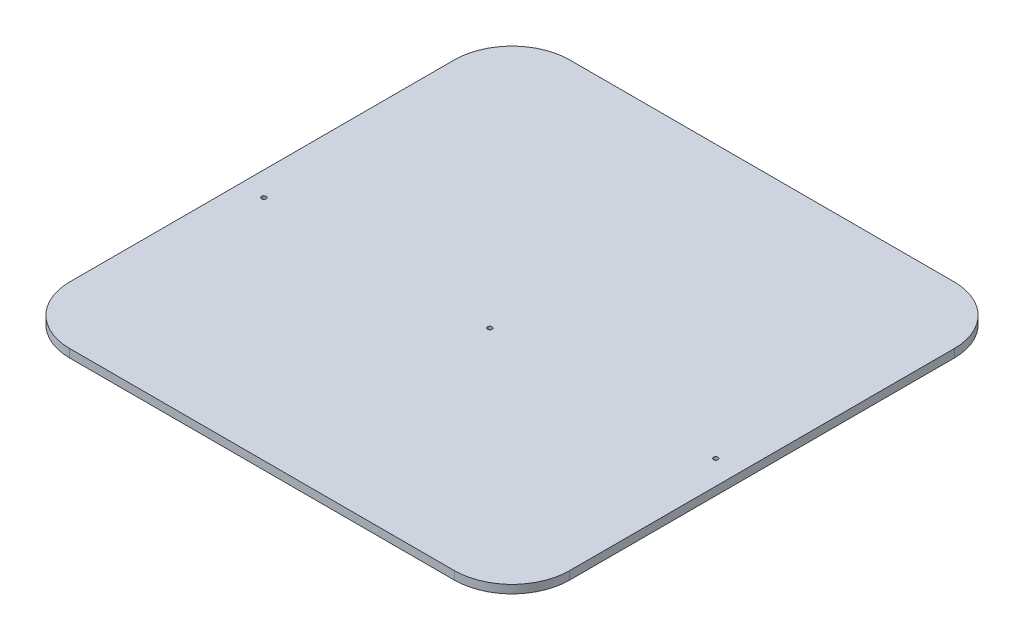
from build123d import *

# Parameters (mm, degrees)
BOSS_EXTRUDE1_DEPTH = 8.73125
SKETCH2_R           = 2.38125
CUT_EXTRUDE1_DEPTH  = 374.68067374


with BuildPart() as part:
    # Sketch1 → Boss-Extrude1 (new body)
    with BuildSketch(Plane(origin=(0, 0, 0), x_dir=(1, 0, 0), z_dir=(0, 1, 0))):
        with BuildLine():
            Line((264.16, 203.2), (264.16, -203.2))
            ThreePointArc((264.16, -203.2), (246.305229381, -246.305229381), (203.2, -264.16))
            Line((203.2, -264.16), (-203.2, -264.16))
            ThreePointArc((-203.2, -264.16), (-246.305229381, -246.305229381), (-264.16, -203.2))
            Line((-264.16, -203.2), (-264.16, 203.2))
            ThreePointArc((-264.16, 203.2), (-246.305229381, 246.305229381), (-203.2, 264.16))
            Line((-203.2, 264.16), (203.2, 264.16))
            ThreePointArc((203.2, 264.16), (246.305229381, 246.305229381), (264.16, 203.2))
        make_face()
    extrude(amount=BOSS_EXTRUDE1_DEPTH)

    # Sketch2 → Cut-Extrude1 (cut, through all)
    with BuildSketch(Plane(origin=(0, 8.73125, 0), x_dir=(1, 0, 0), z_dir=(0, 1, 0))):
        with Locations(Location((-238.76, -23.415625, 0), (0, 0, 270))):
            Circle(SKETCH2_R)
        with Locations(Location((0, -23.415625, 0), (0, 0, 270))):
            Circle(SKETCH2_R)
        with Locations(Location((238.76, -23.415625, 0), (0, 0, 270))):
            Circle(SKETCH2_R)
    extrude(amount=-CUT_EXTRUDE1_DEPTH, mode=Mode.SUBTRACT)


solid = part.part
